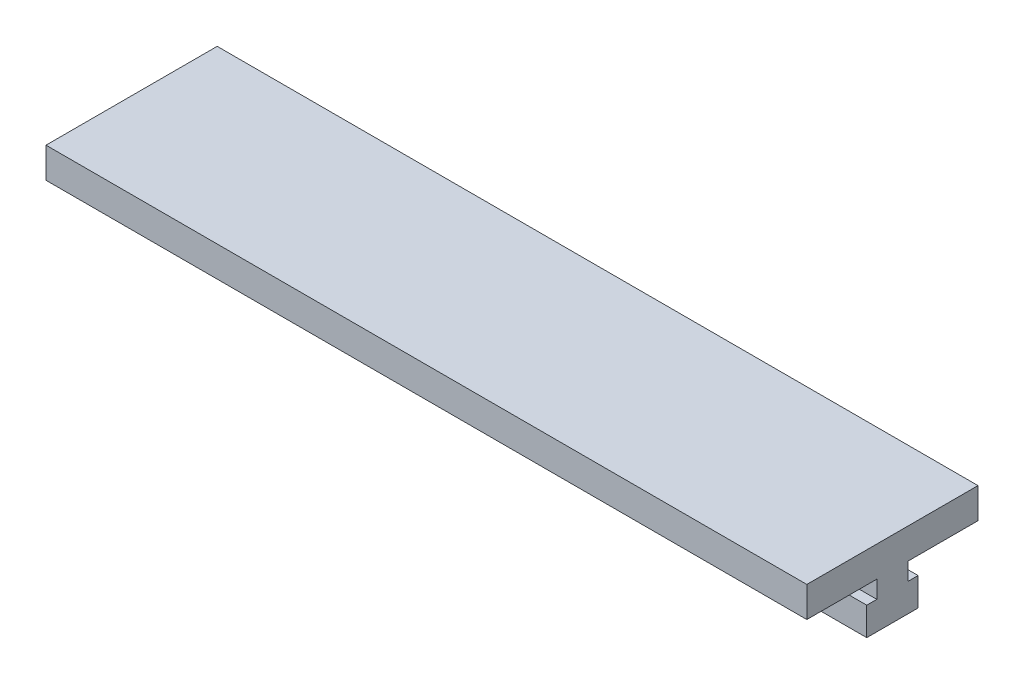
from build123d import *

# Parameters (mm, degrees)
LIUKUKISKOT_1_6043_LIUKUKISKO_8_45_1_DEPTH = 200


with BuildPart() as part:
    # Sketch1 → Liukukiskot 1.6043 LIUKUKISKO 8_45_1 (new body)
    with BuildSketch(Plane(origin=(0, 0, 0), x_dir=(0, 0, -1), z_dir=(1, 0, 0))):
        Polygon((22.632837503, 10.332093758), (-22.367162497, 10.332093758), (-22.367162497, 2.332093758), (-3.967168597, 2.332093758), (-3.967168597, -2.267904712), (-6.617162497, -2.267904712), (-6.617162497, -9.667906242), (6.882837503, -9.667906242), (6.882837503, -2.267904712), (4.232843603, -2.267904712), (4.232843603, 2.332093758), (22.632837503, 2.332093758), align=None)
    extrude(amount=LIUKUKISKOT_1_6043_LIUKUKISKO_8_45_1_DEPTH)


solid = part.part
